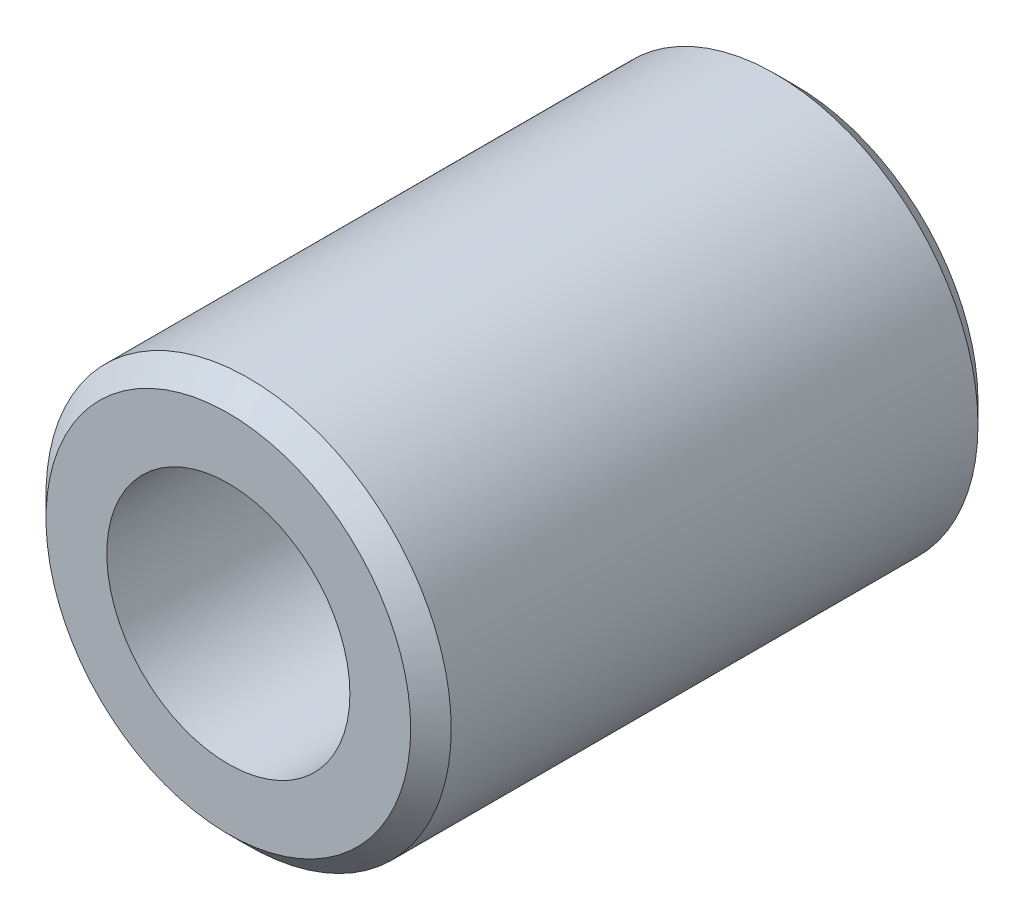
from build123d import *

# Parameters (mm, degrees)
BASE_EXTRUSION_DEPTH      = 3.5
BASE_EXTRUSION_DEPTH_BACK = 3.5
ESQUISSE1_R               = 2.5
ESQUISSE1_R_2             = 1.5
CHANFREIN1_SIZE           = 0.25


with BuildPart() as part:
    # Esquisse1 → Base-Extrusion (new, two sides: drawn at the far end of the back side and taken through both)
    with BuildSketch(Plane.XY.offset(-BASE_EXTRUSION_DEPTH_BACK)):
        with Locations((-14.75, 36)):
            Circle(ESQUISSE1_R)
        with Locations((-14.75, 36)):
            Circle(ESQUISSE1_R_2, mode=Mode.SUBTRACT)
    extrude(amount=BASE_EXTRUSION_DEPTH + BASE_EXTRUSION_DEPTH_BACK)

    # Chanfrein1
    chanfrein1_edges = [part.edges().sort_by_distance(p)[0] for p in [
        (-17.25, 36, 3.5),
        (-17.25, 36, -3.5),
    ]]
    chamfer(chanfrein1_edges, length=CHANFREIN1_SIZE)


solid = part.part
